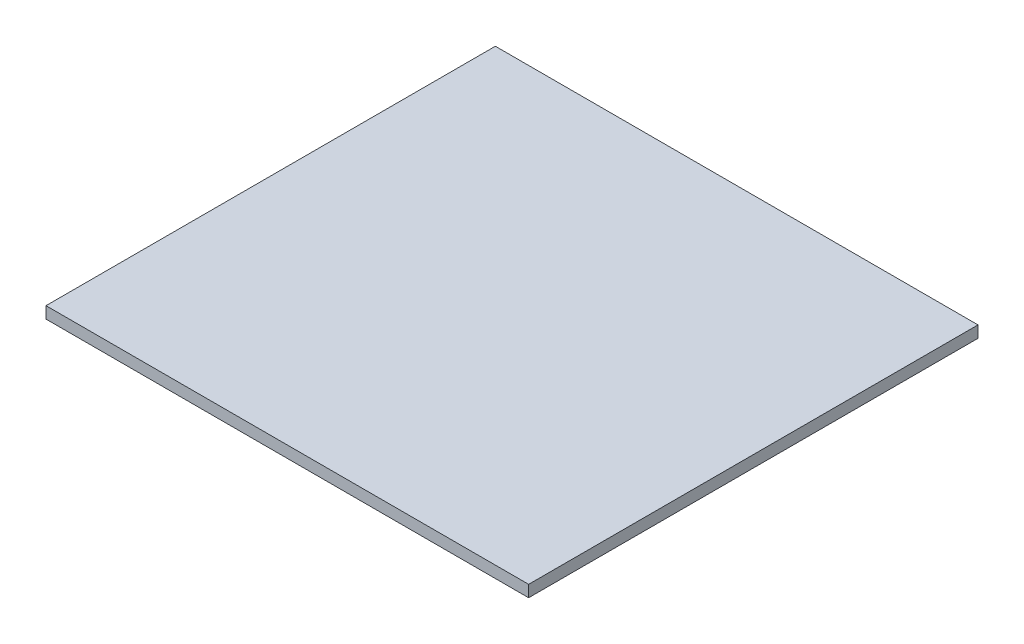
from build123d import *

# Parameters (mm, degrees)
SKIZZE1_W                       = 290
SKIZZE1_H                       = 270
AUFSATZ_LINEAR_AUSTRAGEN1_DEPTH = 7


with BuildPart() as part:
    # Skizze1 → Aufsatz-Linear austragen1 (new body)
    with BuildSketch(Plane(origin=(0, 0, 0), x_dir=(1, 0, 0), z_dir=(0, 1, 0))):
        Rectangle(SKIZZE1_W, SKIZZE1_H)
    extrude(amount=AUFSATZ_LINEAR_AUSTRAGEN1_DEPTH)


solid = part.part
